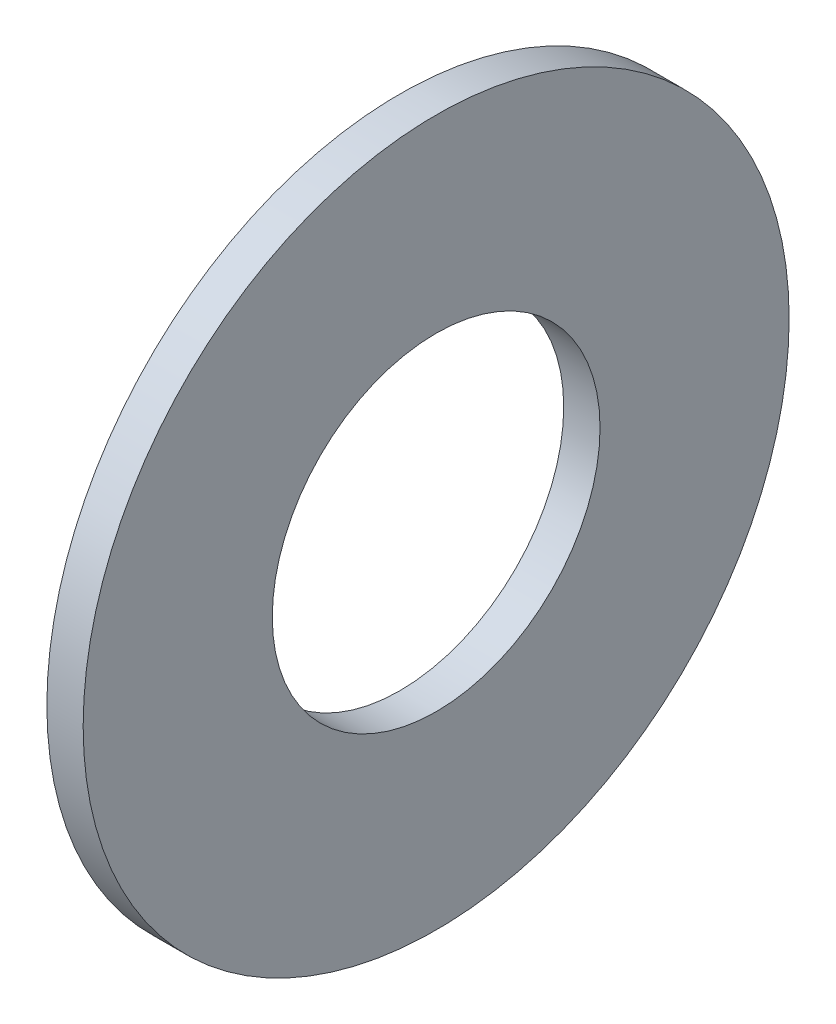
from build123d import *

# Parameters (mm, degrees)
SKETCH1_W = 4.572
SKETCH1_H = 23.8125


with BuildPart() as part:
    # Sketch1 → Base-Revolve (revolve)
    with BuildSketch(Plane.XY, mode=Mode.PRIVATE) as base_revolve_sk:
        with Locations((-2.286, 32.54375)):
            Rectangle(SKETCH1_W, SKETCH1_H)
    revolve(base_revolve_sk.sketch.rotate(Axis((-34.925, 0, 0), (1, 0, 0)), 90), axis=Axis((-34.925, 0, 0), (1, 0, 0)))


solid = part.part
